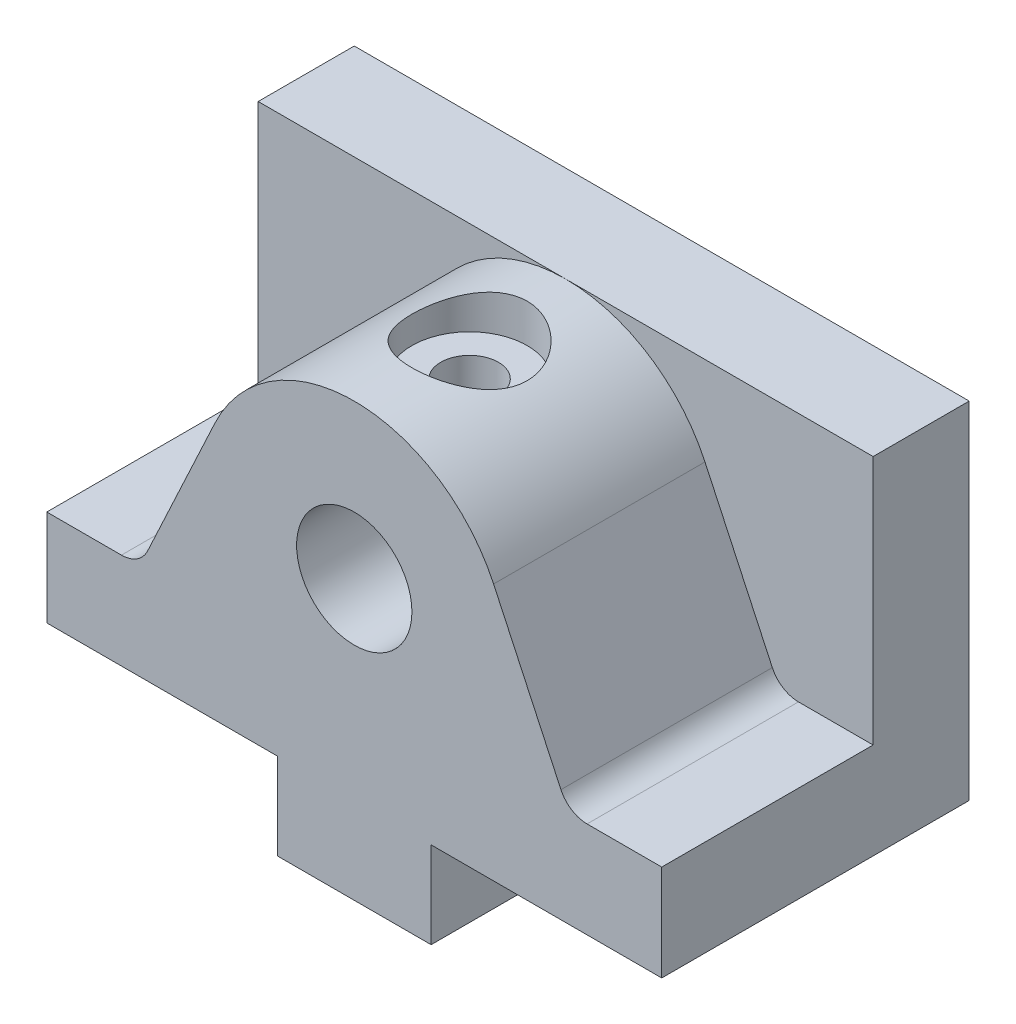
ISO-10303-21;
HEADER;
FILE_DESCRIPTION(('STEP AP214'),'2;1');
FILE_NAME('part.step','',(''),(''),'','','');
FILE_SCHEMA(('AUTOMOTIVE_DESIGN { 1 0 10303 214 1 1 1 1 }'));
ENDSEC;
DATA;
#1=APPLICATION_CONTEXT('core data for automotive mechanical design processes');
#2=APPLICATION_PROTOCOL_DEFINITION('international standard','automotive_design',2000,#1);
#3=PRODUCT_CONTEXT('',#1,'mechanical');
#4=PRODUCT('Part','Part','',(#3));
#5=PRODUCT_RELATED_PRODUCT_CATEGORY('part','',(#4));
#6=PRODUCT_DEFINITION_FORMATION('','',#4);
#7=PRODUCT_DEFINITION_CONTEXT('part definition',#1,'design');
#8=PRODUCT_DEFINITION('design','',#6,#7);
#9=PRODUCT_DEFINITION_SHAPE('','',#8);
#10=(LENGTH_UNIT() NAMED_UNIT(*) SI_UNIT(.MILLI.,.METRE.));
#11=(NAMED_UNIT(*) PLANE_ANGLE_UNIT() SI_UNIT($,.RADIAN.));
#12=(NAMED_UNIT(*) SI_UNIT($,.STERADIAN.) SOLID_ANGLE_UNIT());
#13=UNCERTAINTY_MEASURE_WITH_UNIT(LENGTH_MEASURE(1.E-05),#10,'distance_accuracy_value','');
#14=(GEOMETRIC_REPRESENTATION_CONTEXT(3) GLOBAL_UNCERTAINTY_ASSIGNED_CONTEXT((#13)) GLOBAL_UNIT_ASSIGNED_CONTEXT((#10,
#11,#12)) REPRESENTATION_CONTEXT('',''));
#15=CARTESIAN_POINT('',(0.,0.,0.));
#16=DIRECTION('',(0.,0.,1.));
#17=DIRECTION('',(1.,0.,0.));
#18=AXIS2_PLACEMENT_3D('',#15,#16,#17);
#19=CARTESIAN_POINT('',(-8.,0.,22.));
#20=DIRECTION('',(1.,0.,0.));
#21=DIRECTION('',(0.,1.,0.));
#22=AXIS2_PLACEMENT_3D('',#19,#20,#21);
#23=PLANE('',#22);
#24=DIRECTION('',(0.,0.,-1.));
#25=VECTOR('',#24,1.);
#26=CARTESIAN_POINT('',(-8.,0.,22.));
#27=LINE('',#26,#25);
#28=CARTESIAN_POINT('',(-8.,0.,22.));
#29=VERTEX_POINT('',#28);
#30=CARTESIAN_POINT('',(-8.,0.,-10.));
#31=VERTEX_POINT('',#30);
#32=EDGE_CURVE('E255',#29,#31,#27,.T.);
#33=ORIENTED_EDGE('',*,*,#32,.T.);
#34=DIRECTION('',(0.,1.,0.));
#35=VECTOR('',#34,1.);
#36=CARTESIAN_POINT('',(-8.,0.,-10.));
#37=LINE('',#36,#35);
#38=CARTESIAN_POINT('',(-8.00000000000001,-9.,-10.));
#39=VERTEX_POINT('',#38);
#40=EDGE_CURVE('E205',#39,#31,#37,.T.);
#41=ORIENTED_EDGE('',*,*,#40,.F.);
#42=DIRECTION('',(0.,0.,-1.));
#43=VECTOR('',#42,1.);
#44=CARTESIAN_POINT('',(-8.00000000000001,-9.,22.));
#45=LINE('',#44,#43);
#46=CARTESIAN_POINT('',(-8.00000000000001,-9.,22.));
#47=VERTEX_POINT('',#46);
#48=EDGE_CURVE('E278',#47,#39,#45,.T.);
#49=ORIENTED_EDGE('',*,*,#48,.F.);
#50=DIRECTION('',(0.,-1.,0.));
#51=VECTOR('',#50,1.);
#52=CARTESIAN_POINT('',(-8.,0.,22.));
#53=LINE('',#52,#51);
#54=EDGE_CURVE('E228',#29,#47,#53,.T.);
#55=ORIENTED_EDGE('',*,*,#54,.F.);
#56=EDGE_LOOP('',(#33,#41,#49,#55));
#57=FACE_BOUND('',#56,.T.);
#58=ADVANCED_FACE('F39',(#57),#23,.F.);
#59=CARTESIAN_POINT('',(-8.00000000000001,-9.,22.));
#60=DIRECTION('',(0.,1.,0.));
#61=DIRECTION('',(0.,0.,1.));
#62=AXIS2_PLACEMENT_3D('',#59,#60,#61);
#63=PLANE('',#62);
#64=CARTESIAN_POINT('',(0.,-9.,14.));
#65=DIRECTION('',(0.,-1.,0.));
#66=DIRECTION('',(0.,0.,-1.));
#67=AXIS2_PLACEMENT_3D('',#64,#65,#66);
#68=CIRCLE('',#67,3.);
#69=CARTESIAN_POINT('',(0.,-9.,11.));
#70=VERTEX_POINT('',#69);
#71=EDGE_CURVE('E176',#70,#70,#68,.T.);
#72=ORIENTED_EDGE('',*,*,#71,.F.);
#73=EDGE_LOOP('',(#72));
#74=FACE_BOUND('',#73,.T.);
#75=CARTESIAN_POINT('',(0.,-9.,-2.));
#76=DIRECTION('',(0.,-1.,0.));
#77=DIRECTION('',(0.,0.,-1.));
#78=AXIS2_PLACEMENT_3D('',#75,#76,#77);
#79=CIRCLE('',#78,3.);
#80=CARTESIAN_POINT('',(0.,-9.,-5.));
#81=VERTEX_POINT('',#80);
#82=EDGE_CURVE('E175',#81,#81,#79,.T.);
#83=ORIENTED_EDGE('',*,*,#82,.F.);
#84=EDGE_LOOP('',(#83));
#85=FACE_BOUND('',#84,.T.);
#86=ORIENTED_EDGE('',*,*,#48,.T.);
#87=DIRECTION('',(-1.,0.,0.));
#88=VECTOR('',#87,1.);
#89=CARTESIAN_POINT('',(-8.00000000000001,-9.,-10.));
#90=LINE('',#89,#88);
#91=CARTESIAN_POINT('',(7.99999999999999,-9.,-10.));
#92=VERTEX_POINT('',#91);
#93=EDGE_CURVE('E202',#92,#39,#90,.T.);
#94=ORIENTED_EDGE('',*,*,#93,.F.);
#95=DIRECTION('',(0.,0.,-1.));
#96=VECTOR('',#95,1.);
#97=CARTESIAN_POINT('',(7.99999999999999,-9.,22.));
#98=LINE('',#97,#96);
#99=CARTESIAN_POINT('',(7.99999999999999,-9.,22.));
#100=VERTEX_POINT('',#99);
#101=EDGE_CURVE('E453',#100,#92,#98,.T.);
#102=ORIENTED_EDGE('',*,*,#101,.F.);
#103=DIRECTION('',(1.,0.,0.));
#104=VECTOR('',#103,1.);
#105=CARTESIAN_POINT('',(-8.00000000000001,-9.,22.));
#106=LINE('',#105,#104);
#107=EDGE_CURVE('E231',#47,#100,#106,.T.);
#108=ORIENTED_EDGE('',*,*,#107,.F.);
#109=EDGE_LOOP('',(#86,#94,#102,#108));
#110=FACE_BOUND('',#109,.T.);
#111=ADVANCED_FACE('F313',(#74,#85,#110),#63,.F.);
#112=CARTESIAN_POINT('',(7.99999999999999,-9.,22.));
#113=DIRECTION('',(-1.,0.,0.));
#114=DIRECTION('',(0.,-1.,0.));
#115=AXIS2_PLACEMENT_3D('',#112,#113,#114);
#116=PLANE('',#115);
#117=ORIENTED_EDGE('',*,*,#101,.T.);
#118=DIRECTION('',(0.,-1.,0.));
#119=VECTOR('',#118,1.);
#120=CARTESIAN_POINT('',(7.99999999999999,-9.,-10.));
#121=LINE('',#120,#119);
#122=CARTESIAN_POINT('',(8.,0.,-10.));
#123=VERTEX_POINT('',#122);
#124=EDGE_CURVE('E198',#123,#92,#121,.T.);
#125=ORIENTED_EDGE('',*,*,#124,.F.);
#126=DIRECTION('',(0.,0.,-1.));
#127=VECTOR('',#126,1.);
#128=CARTESIAN_POINT('',(8.,0.,22.));
#129=LINE('',#128,#127);
#130=CARTESIAN_POINT('',(8.,0.,22.));
#131=VERTEX_POINT('',#130);
#132=EDGE_CURVE('E433',#131,#123,#129,.T.);
#133=ORIENTED_EDGE('',*,*,#132,.F.);
#134=DIRECTION('',(0.,1.,0.));
#135=VECTOR('',#134,1.);
#136=CARTESIAN_POINT('',(7.99999999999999,-9.,22.));
#137=LINE('',#136,#135);
#138=EDGE_CURVE('E234',#100,#131,#137,.T.);
#139=ORIENTED_EDGE('',*,*,#138,.F.);
#140=EDGE_LOOP('',(#117,#125,#133,#139));
#141=FACE_BOUND('',#140,.T.);
#142=ADVANCED_FACE('F319',(#141),#116,.F.);
#143=CARTESIAN_POINT('',(8.,0.,22.));
#144=DIRECTION('',(0.,1.,0.));
#145=DIRECTION('',(0.,0.,1.));
#146=AXIS2_PLACEMENT_3D('',#143,#144,#145);
#147=PLANE('',#146);
#148=ORIENTED_EDGE('',*,*,#132,.T.);
#149=DIRECTION('',(-1.,0.,0.));
#150=VECTOR('',#149,1.);
#151=CARTESIAN_POINT('',(8.,0.,-10.));
#152=LINE('',#151,#150);
#153=CARTESIAN_POINT('',(32.,0.,-10.));
#154=VERTEX_POINT('',#153);
#155=EDGE_CURVE('E195',#154,#123,#152,.T.);
#156=ORIENTED_EDGE('',*,*,#155,.F.);
#157=DIRECTION('',(0.,0.,-1.));
#158=VECTOR('',#157,1.);
#159=CARTESIAN_POINT('',(32.,0.,22.));
#160=LINE('',#159,#158);
#161=CARTESIAN_POINT('',(32.,0.,22.));
#162=VERTEX_POINT('',#161);
#163=EDGE_CURVE('E431',#162,#154,#160,.T.);
#164=ORIENTED_EDGE('',*,*,#163,.F.);
#165=DIRECTION('',(1.,0.,0.));
#166=VECTOR('',#165,1.);
#167=CARTESIAN_POINT('',(8.,0.,22.));
#168=LINE('',#167,#166);
#169=EDGE_CURVE('E236',#131,#162,#168,.T.);
#170=ORIENTED_EDGE('',*,*,#169,.F.);
#171=EDGE_LOOP('',(#148,#156,#164,#170));
#172=FACE_BOUND('',#171,.T.);
#173=ADVANCED_FACE('F325',(#172),#147,.F.);
#174=CARTESIAN_POINT('',(32.,0.,22.));
#175=DIRECTION('',(-1.,0.,0.));
#176=DIRECTION('',(0.,0.,1.));
#177=AXIS2_PLACEMENT_3D('',#174,#175,#176);
#178=PLANE('',#177);
#179=ORIENTED_EDGE('',*,*,#163,.T.);
#180=DIRECTION('',(0.,-1.,0.));
#181=VECTOR('',#180,1.);
#182=CARTESIAN_POINT('',(32.,36.,-10.));
#183=LINE('',#182,#181);
#184=CARTESIAN_POINT('',(32.,36.,-10.));
#185=VERTEX_POINT('',#184);
#186=EDGE_CURVE('E215',#185,#154,#183,.T.);
#187=ORIENTED_EDGE('',*,*,#186,.F.);
#188=DIRECTION('',(0.,0.,1.));
#189=VECTOR('',#188,1.);
#190=CARTESIAN_POINT('',(32.,36.,-10.));
#191=LINE('',#190,#189);
#192=CARTESIAN_POINT('',(32.,36.,0.));
#193=VERTEX_POINT('',#192);
#194=EDGE_CURVE('E218',#185,#193,#191,.T.);
#195=ORIENTED_EDGE('',*,*,#194,.T.);
#196=DIRECTION('',(0.,-1.,0.));
#197=VECTOR('',#196,1.);
#198=CARTESIAN_POINT('',(32.,0.,0.));
#199=LINE('',#198,#197);
#200=CARTESIAN_POINT('',(32.,10.,0.));
#201=VERTEX_POINT('',#200);
#202=EDGE_CURVE('E199',#193,#201,#199,.T.);
#203=ORIENTED_EDGE('',*,*,#202,.T.);
#204=DIRECTION('',(0.,0.,-1.));
#205=VECTOR('',#204,1.);
#206=CARTESIAN_POINT('',(32.,10.,22.));
#207=LINE('',#206,#205);
#208=CARTESIAN_POINT('',(32.,10.,22.));
#209=VERTEX_POINT('',#208);
#210=EDGE_CURVE('E429',#209,#201,#207,.T.);
#211=ORIENTED_EDGE('',*,*,#210,.F.);
#212=DIRECTION('',(0.,1.,0.));
#213=VECTOR('',#212,1.);
#214=CARTESIAN_POINT('',(32.,0.,22.));
#215=LINE('',#214,#213);
#216=EDGE_CURVE('E238',#162,#209,#215,.T.);
#217=ORIENTED_EDGE('',*,*,#216,.F.);
#218=EDGE_LOOP('',(#179,#187,#195,#203,#211,#217));
#219=FACE_BOUND('',#218,.T.);
#220=ADVANCED_FACE('F329',(#219),#178,.F.);
#221=CARTESIAN_POINT('',(32.,10.,22.));
#222=DIRECTION('',(0.,-1.,0.));
#223=DIRECTION('',(1.,0.,0.));
#224=AXIS2_PLACEMENT_3D('',#221,#222,#223);
#225=PLANE('',#224);
#226=DIRECTION('',(-1.,0.,0.));
#227=VECTOR('',#226,1.);
#228=CARTESIAN_POINT('',(32.,10.,0.));
#229=LINE('',#228,#227);
#230=CARTESIAN_POINT('',(24.2283340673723,9.99999999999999,0.));
#231=VERTEX_POINT('',#230);
#232=EDGE_CURVE('E259',#201,#231,#229,.T.);
#233=ORIENTED_EDGE('',*,*,#232,.T.);
#234=DIRECTION('',(0.,0.,-1.));
#235=VECTOR('',#234,1.);
#236=CARTESIAN_POINT('',(24.2283340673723,9.99999999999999,22.));
#237=LINE('',#236,#235);
#238=CARTESIAN_POINT('',(24.2283340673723,9.99999999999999,22.));
#239=VERTEX_POINT('',#238);
#240=EDGE_CURVE('E59',#231,#239,#237,.F.);
#241=ORIENTED_EDGE('',*,*,#240,.T.);
#242=DIRECTION('',(-1.,0.,0.));
#243=VECTOR('',#242,1.);
#244=CARTESIAN_POINT('',(32.,10.,22.));
#245=LINE('',#244,#243);
#246=EDGE_CURVE('E240',#209,#239,#245,.T.);
#247=ORIENTED_EDGE('',*,*,#246,.F.);
#248=ORIENTED_EDGE('',*,*,#210,.T.);
#249=EDGE_LOOP('',(#233,#241,#247,#248));
#250=FACE_BOUND('',#249,.T.);
#251=ADVANCED_FACE('F333',(#250),#225,.F.);
#252=CARTESIAN_POINT('',(22.3171232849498,9.99999999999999,22.));
#253=DIRECTION('',(-0.906307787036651,-0.422618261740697,0.));
#254=DIRECTION('',(0.422618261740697,-0.906307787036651,0.));
#255=AXIS2_PLACEMENT_3D('',#252,#253,#254);
#256=PLANE('',#255);
#257=DIRECTION('',(-0.422618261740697,0.906307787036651,0.));
#258=VECTOR('',#257,1.);
#259=CARTESIAN_POINT('',(22.3171232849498,9.99999999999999,22.));
#260=LINE('',#259,#258);
#261=CARTESIAN_POINT('',(21.5094107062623,11.7321452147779,22.));
#262=VERTEX_POINT('',#261);
#263=CARTESIAN_POINT('',(14.5009245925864,26.7618921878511,22.));
#264=VERTEX_POINT('',#263);
#265=EDGE_CURVE('E242',#262,#264,#260,.T.);
#266=ORIENTED_EDGE('',*,*,#265,.F.);
#267=DIRECTION('',(0.,0.,-1.));
#268=VECTOR('',#267,1.);
#269=CARTESIAN_POINT('',(21.5094107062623,11.7321452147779,0.));
#270=LINE('',#269,#268);
#271=CARTESIAN_POINT('',(21.5094107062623,11.7321452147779,0.));
#272=VERTEX_POINT('',#271);
#273=EDGE_CURVE('E282',#262,#272,#270,.T.);
#274=ORIENTED_EDGE('',*,*,#273,.T.);
#275=DIRECTION('',(-0.422618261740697,0.906307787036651,0.));
#276=VECTOR('',#275,1.);
#277=CARTESIAN_POINT('',(22.3171232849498,9.99999999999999,0.));
#278=LINE('',#277,#276);
#279=CARTESIAN_POINT('',(14.5009245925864,26.7618921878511,0.));
#280=VERTEX_POINT('',#279);
#281=EDGE_CURVE('E256',#272,#280,#278,.T.);
#282=ORIENTED_EDGE('',*,*,#281,.T.);
#283=DIRECTION('',(0.,0.,-1.));
#284=VECTOR('',#283,1.);
#285=CARTESIAN_POINT('',(14.5009245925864,26.7618921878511,22.));
#286=LINE('',#285,#284);
#287=EDGE_CURVE('E298',#264,#280,#286,.T.);
#288=ORIENTED_EDGE('',*,*,#287,.F.);
#289=EDGE_LOOP('',(#266,#274,#282,#288));
#290=FACE_BOUND('',#289,.T.);
#291=ADVANCED_FACE('F296',(#290),#256,.F.);
#292=CARTESIAN_POINT('',(0.,20.,22.));
#293=DIRECTION('',(0.,0.,-1.));
#294=DIRECTION('',(-1.,0.,0.));
#295=AXIS2_PLACEMENT_3D('',#292,#293,#294);
#296=CYLINDRICAL_SURFACE('',#295,16.);
#297=CARTESIAN_POINT('',(0.,36.,16.));
#298=CARTESIAN_POINT('',(-0.162427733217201,36.0000005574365,16.0000007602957));
#299=CARTESIAN_POINT('',(-0.324844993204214,35.997521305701,15.9933993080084));
#300=CARTESIAN_POINT('',(-0.648520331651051,35.9876715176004,15.9670588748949));
#301=CARTESIAN_POINT('',(-0.809777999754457,35.9802993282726,15.9473154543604));
#302=CARTESIAN_POINT('',(-1.12979634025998,35.9608661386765,15.8948993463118));
#303=CARTESIAN_POINT('',(-1.28855831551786,35.9488076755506,15.862233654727));
#304=CARTESIAN_POINT('',(-1.60261141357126,35.920317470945,15.7842738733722));
#305=CARTESIAN_POINT('',(-1.75790116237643,35.9038840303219,15.7389748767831));
#306=CARTESIAN_POINT('',(-2.06353693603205,35.8671186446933,15.6362882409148));
#307=CARTESIAN_POINT('',(-2.2138937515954,35.8467959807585,15.5789293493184));
#308=CARTESIAN_POINT('',(-2.50915130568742,35.8027355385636,15.4525186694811));
#309=CARTESIAN_POINT('',(-2.6540499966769,35.7789964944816,15.3834625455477));
#310=CARTESIAN_POINT('',(-2.93745114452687,35.7287028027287,15.2342168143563));
#311=CARTESIAN_POINT('',(-3.07595454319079,35.7021485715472,15.1540288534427));
#312=CARTESIAN_POINT('',(-3.3458591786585,35.6468595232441,14.9830470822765));
#313=CARTESIAN_POINT('',(-3.47725782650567,35.618123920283,14.8922494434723));
#314=CARTESIAN_POINT('',(-3.73705610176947,35.5580480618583,14.6970003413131));
#315=CARTESIAN_POINT('',(-3.86515055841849,35.5266502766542,14.5921603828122));
#316=CARTESIAN_POINT('',(-4.11214204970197,35.4630706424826,14.372369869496));
#317=CARTESIAN_POINT('',(-4.23103881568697,35.4308887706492,14.2574190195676));
#318=CARTESIAN_POINT('',(-4.45900396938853,35.3665649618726,14.0180360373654));
#319=CARTESIAN_POINT('',(-4.56806779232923,35.334423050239,13.8935995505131));
#320=CARTESIAN_POINT('',(-4.7756151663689,35.2710599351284,13.6360477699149));
#321=CARTESIAN_POINT('',(-4.87410227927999,35.2398384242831,13.5029354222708));
#322=CARTESIAN_POINT('',(-5.06349317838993,35.1779887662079,13.2234482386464));
#323=CARTESIAN_POINT('',(-5.15395768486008,35.1474300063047,13.0767598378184));
#324=CARTESIAN_POINT('',(-5.32210766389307,35.0891712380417,12.7757656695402));
#325=CARTESIAN_POINT('',(-5.39979826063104,35.0614700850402,12.6214629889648));
#326=CARTESIAN_POINT('',(-5.54178841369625,35.0098065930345,12.3061815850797));
#327=CARTESIAN_POINT('',(-5.60608640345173,34.9858446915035,12.1452020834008));
#328=CARTESIAN_POINT('',(-5.72063465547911,34.9424928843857,11.81780057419));
#329=CARTESIAN_POINT('',(-5.77089169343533,34.9231007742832,11.6513812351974));
#330=CARTESIAN_POINT('',(-5.85511762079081,34.8902504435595,11.3211525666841));
#331=CARTESIAN_POINT('',(-5.88966490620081,34.8765832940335,11.1575115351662));
#332=CARTESIAN_POINT('',(-5.94499608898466,34.8545586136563,10.8276330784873));
#333=CARTESIAN_POINT('',(-5.96578600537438,34.8461987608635,10.6613968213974));
#334=CARTESIAN_POINT('',(-5.99338932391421,34.8350769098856,10.3276054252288));
#335=CARTESIAN_POINT('',(-6.00020481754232,34.8323140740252,10.1600504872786));
#336=CARTESIAN_POINT('',(-5.99978582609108,34.8324836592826,9.82496442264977));
#337=CARTESIAN_POINT('',(-5.99255188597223,34.8354158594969,9.65743329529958));
#338=CARTESIAN_POINT('',(-5.9649764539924,34.8465233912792,9.33379681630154));
#339=CARTESIAN_POINT('',(-5.94544909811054,34.8543729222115,9.17761005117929));
#340=CARTESIAN_POINT('',(-5.89424692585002,34.8747642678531,8.86749914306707));
#341=CARTESIAN_POINT('',(-5.86256807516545,34.887307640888,8.713575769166));
#342=CARTESIAN_POINT('',(-5.78737202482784,34.9167004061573,8.40911721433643));
#343=CARTESIAN_POINT('',(-5.74385788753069,34.9335486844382,8.25858116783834));
#344=CARTESIAN_POINT('',(-5.64535023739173,34.9710653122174,7.96174446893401));
#345=CARTESIAN_POINT('',(-5.59035233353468,34.9917351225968,7.8154454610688));
#346=CARTESIAN_POINT('',(-5.46820476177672,35.0367233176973,7.52533536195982));
#347=CARTESIAN_POINT('',(-5.40084887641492,35.0611021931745,7.3816205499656));
#348=CARTESIAN_POINT('',(-5.25517504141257,35.112547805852,7.10030421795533));
#349=CARTESIAN_POINT('',(-5.17685336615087,35.1396154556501,6.96270479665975));
#350=CARTESIAN_POINT('',(-5.00978390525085,35.1957174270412,6.69439199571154));
#351=CARTESIAN_POINT('',(-4.92103495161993,35.2247519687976,6.56367938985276));
#352=CARTESIAN_POINT('',(-4.73365945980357,35.2840480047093,6.30982948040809));
#353=CARTESIAN_POINT('',(-4.63503247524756,35.3143095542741,6.18669251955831));
#354=CARTESIAN_POINT('',(-4.42148606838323,35.3773753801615,5.94059609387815));
#355=CARTESIAN_POINT('',(-4.30591643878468,35.4102134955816,5.81820873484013));
#356=CARTESIAN_POINT('',(-4.06489568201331,35.4755357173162,5.58356444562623));
#357=CARTESIAN_POINT('',(-3.93944756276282,35.5080199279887,5.47130445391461));
#358=CARTESIAN_POINT('',(-3.67930542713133,35.5717902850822,5.25752502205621));
#359=CARTESIAN_POINT('',(-3.54460652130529,35.6030757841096,5.15601133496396));
#360=CARTESIAN_POINT('',(-3.26687700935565,35.6635788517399,4.96453057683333));
#361=CARTESIAN_POINT('',(-3.1238497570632,35.6927972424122,4.87455890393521));
#362=CARTESIAN_POINT('',(-2.8279450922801,35.7488334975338,4.7054533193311));
#363=CARTESIAN_POINT('',(-2.67494692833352,35.7756056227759,4.62651523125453));
#364=CARTESIAN_POINT('',(-2.3622882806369,35.8254428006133,4.48191640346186));
#365=CARTESIAN_POINT('',(-2.20263047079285,35.8485093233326,4.4162503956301));
#366=CARTESIAN_POINT('',(-1.87775996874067,35.8902747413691,4.29878554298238));
#367=CARTESIAN_POINT('',(-1.71254812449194,35.9089742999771,4.24698459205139));
#368=CARTESIAN_POINT('',(-1.37781252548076,35.941452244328,4.15777194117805));
#369=CARTESIAN_POINT('',(-1.20828902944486,35.9552309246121,4.12035938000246));
#370=CARTESIAN_POINT('',(-0.875397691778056,35.9768584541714,4.06192787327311));
#371=CARTESIAN_POINT('',(-0.71218192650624,35.9849836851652,4.04014291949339));
#372=CARTESIAN_POINT('',(-0.384342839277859,35.9962238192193,4.01006070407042));
#373=CARTESIAN_POINT('',(-0.219719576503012,35.9993389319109,4.00176287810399));
#374=CARTESIAN_POINT('',(0.10963649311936,36.0004717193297,3.99874206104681));
#375=CARTESIAN_POINT('',(0.274369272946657,35.9984903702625,4.0040164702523));
#376=CARTESIAN_POINT('',(0.602703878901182,35.9894877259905,4.02807883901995));
#377=CARTESIAN_POINT('',(0.766305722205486,35.9824665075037,4.04686659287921));
#378=CARTESIAN_POINT('',(1.08484961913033,35.9639458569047,4.09677376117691));
#379=CARTESIAN_POINT('',(1.23988188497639,35.9526301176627,4.1273881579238));
#380=CARTESIAN_POINT('',(1.54675761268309,35.9258052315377,4.20065226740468));
#381=CARTESIAN_POINT('',(1.69860000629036,35.9102947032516,4.24330594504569));
#382=CARTESIAN_POINT('',(1.99802063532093,35.8754724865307,4.3402587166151));
#383=CARTESIAN_POINT('',(2.14560001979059,35.85616183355,4.39455463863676));
#384=CARTESIAN_POINT('',(2.43569439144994,35.8141987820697,4.51437951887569));
#385=CARTESIAN_POINT('',(2.5782074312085,35.791545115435,4.57991274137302));
#386=CARTESIAN_POINT('',(2.8613459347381,35.7427421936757,4.72376640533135));
#387=CARTESIAN_POINT('',(3.00179672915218,35.7165106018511,4.80240263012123));
#388=CARTESIAN_POINT('',(3.27565209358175,35.6617244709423,4.97049434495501));
#389=CARTESIAN_POINT('',(3.40905422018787,35.6331691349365,5.05995355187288));
#390=CARTESIAN_POINT('',(3.66805220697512,35.574435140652,5.24909372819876));
#391=CARTESIAN_POINT('',(3.79364691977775,35.5442562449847,5.34877619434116));
#392=CARTESIAN_POINT('',(4.03634135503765,35.4830105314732,5.55774902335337));
#393=CARTESIAN_POINT('',(4.1534407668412,35.4519436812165,5.66703973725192));
#394=CARTESIAN_POINT('',(4.3850769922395,35.3878643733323,5.9012462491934));
#395=CARTESIAN_POINT('',(4.49906697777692,35.3548440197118,6.02670141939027));
#396=CARTESIAN_POINT('',(4.71608180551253,35.2895850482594,6.28687984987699));
#397=CARTESIAN_POINT('',(4.81911014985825,35.2573461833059,6.42160012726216));
#398=CARTESIAN_POINT('',(5.01360921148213,35.194544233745,6.69961873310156));
#399=CARTESIAN_POINT('',(5.10507411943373,35.163981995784,6.84292132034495));
#400=CARTESIAN_POINT('',(5.27567954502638,35.1054737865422,7.13711577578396));
#401=CARTESIAN_POINT('',(5.35482524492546,35.0775267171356,7.2880044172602));
#402=CARTESIAN_POINT('',(5.50053123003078,35.0249854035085,7.59718997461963));
#403=CARTESIAN_POINT('',(5.5670312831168,35.0004073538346,7.75551807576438));
#404=CARTESIAN_POINT('',(5.68634828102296,34.9555845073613,8.07777478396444));
#405=CARTESIAN_POINT('',(5.73917096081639,34.9353378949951,8.241701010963));
#406=CARTESIAN_POINT('',(5.8306145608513,34.89987725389,8.57395243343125));
#407=CARTESIAN_POINT('',(5.86923979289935,34.884661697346,8.74227627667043));
#408=CARTESIAN_POINT('',(5.93187603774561,34.8598111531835,9.08202494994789));
#409=CARTESIAN_POINT('',(5.95588806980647,34.8501757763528,9.25344956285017));
#410=CARTESIAN_POINT('',(5.98795090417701,34.8372746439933,9.58688079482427));
#411=CARTESIAN_POINT('',(5.99692832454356,34.8336393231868,9.74878464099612));
#412=CARTESIAN_POINT('',(6.00174553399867,34.8316910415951,10.0728179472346));
#413=CARTESIAN_POINT('',(5.99758576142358,34.8333779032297,10.2349473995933));
#414=CARTESIAN_POINT('',(5.97617513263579,34.8420167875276,10.5581793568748));
#415=CARTESIAN_POINT('',(5.9589255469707,34.8489682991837,10.7192819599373));
#416=CARTESIAN_POINT('',(5.91152013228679,34.8679043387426,11.0392740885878));
#417=CARTESIAN_POINT('',(5.88136431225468,34.8798888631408,11.1981636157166));
#418=CARTESIAN_POINT('',(5.80957518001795,34.9080606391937,11.5077481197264));
#419=CARTESIAN_POINT('',(5.76832374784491,34.9241071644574,11.65854478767));
#420=CARTESIAN_POINT('',(5.67433519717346,34.9600952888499,11.9560860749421));
#421=CARTESIAN_POINT('',(5.62159429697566,34.9800381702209,12.1028293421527));
#422=CARTESIAN_POINT('',(5.50506367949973,35.0232530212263,12.3913315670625));
#423=CARTESIAN_POINT('',(5.44127561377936,35.0465244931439,12.5330912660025));
#424=CARTESIAN_POINT('',(5.30311395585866,35.0957729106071,12.8108859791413));
#425=CARTESIAN_POINT('',(5.22873653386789,35.1217508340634,12.9469188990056));
#426=CARTESIAN_POINT('',(4.98217098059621,35.2055628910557,13.359141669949));
#427=CARTESIAN_POINT('',(4.79257489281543,35.2669336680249,13.6244522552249));
#428=CARTESIAN_POINT('',(4.37331782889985,35.3922641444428,14.1206371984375));
#429=CARTESIAN_POINT('',(4.14364411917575,35.4562246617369,14.3515005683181));
#430=CARTESIAN_POINT('',(3.76647526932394,35.5509413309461,14.6736561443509));
#431=CARTESIAN_POINT('',(3.63140882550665,35.5831105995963,14.7793645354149));
#432=CARTESIAN_POINT('',(3.35244180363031,35.6454953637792,14.979007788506));
#433=CARTESIAN_POINT('',(3.2085445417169,35.6757115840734,15.0729470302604));
#434=CARTESIAN_POINT('',(2.9127270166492,35.7333640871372,15.2483917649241));
#435=CARTESIAN_POINT('',(2.76080251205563,35.7607988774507,15.3298905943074));
#436=CARTESIAN_POINT('',(2.45006904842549,35.8120821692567,15.4796800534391));
#437=CARTESIAN_POINT('',(2.29126304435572,35.8359321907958,15.5479762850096));
#438=CARTESIAN_POINT('',(1.96075860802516,35.8803154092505,15.6734482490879));
#439=CARTESIAN_POINT('',(1.78880001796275,35.9006582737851,15.7300080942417));
#440=CARTESIAN_POINT('',(1.43995213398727,35.9360368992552,15.8274639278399));
#441=CARTESIAN_POINT('',(1.26306259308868,35.9510723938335,15.8683591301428));
#442=CARTESIAN_POINT('',(0.905989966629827,35.9753306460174,15.9339800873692));
#443=CARTESIAN_POINT('',(0.725808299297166,35.9845558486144,15.9587126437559));
#444=CARTESIAN_POINT('',(0.363746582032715,35.9968898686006,15.9917212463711));
#445=CARTESIAN_POINT('',(0.181866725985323,35.9999993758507,15.9999991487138));
#446=CARTESIAN_POINT('',(0.,36.,16.));
#447=B_SPLINE_CURVE_WITH_KNOTS('',3,(#297,#298,#299,#300,#301,#302,#303,#304,#305,#306,#307,
#308,#309,#310,#311,#312,#313,#314,#315,#316,#317,#318,#319,#320,#321,#322,#323,#324,#325,#326,
#327,#328,#329,#330,#331,#332,#333,#334,#335,#336,#337,#338,#339,#340,#341,#342,#343,#344,#345,
#346,#347,#348,#349,#350,#351,#352,#353,#354,#355,#356,#357,#358,#359,#360,#361,#362,#363,#364,
#365,#366,#367,#368,#369,#370,#371,#372,#373,#374,#375,#376,#377,#378,#379,#380,#381,#382,#383,
#384,#385,#386,#387,#388,#389,#390,#391,#392,#393,#394,#395,#396,#397,#398,#399,#400,#401,#402,
#403,#404,#405,#406,#407,#408,#409,#410,#411,#412,#413,#414,#415,#416,#417,#418,#419,#420,#421,
#422,#423,#424,#425,#426,#427,#428,#429,#430,#431,#432,#433,#434,#435,#436,#437,#438,#439,#440,
#441,#442,#443,#444,#445,#446),.UNSPECIFIED.,.T.,.F.,(4,2,2,2,2,2,2,2,2,2,2,2,2,2,2,2,2,2,2,2,2,
2,2,2,2,2,2,2,2,2,2,2,2,2,2,2,2,2,2,2,2,2,2,2,2,2,2,2,2,2,2,2,2,2,2,2,2,2,2,2,2,2,2,2,2,2,2,2,2,
2,2,2,2,2,4),(0.,0.48711292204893,0.974390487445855,1.46140460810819,1.94860815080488,
2.43466323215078,2.92089887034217,3.40706267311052,3.89340245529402,4.39827808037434,
4.90316844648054,5.40829200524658,5.91324492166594,6.43768308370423,6.96191035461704,
7.48619891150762,8.01023402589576,8.51299593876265,9.01553774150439,9.51800432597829,
10.0204514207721,10.4926927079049,10.9650909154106,11.4373670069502,11.9098240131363,
12.3910323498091,12.8724045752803,13.3538307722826,13.8352787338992,14.349198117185,
14.8629616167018,15.3769987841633,15.8908303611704,16.4128602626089,16.9346825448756,
17.4564255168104,17.9781372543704,18.4721042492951,18.9660505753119,19.4599022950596,
19.9537464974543,20.4284916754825,20.9033933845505,21.3781658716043,21.8531189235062,
22.3418491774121,22.830747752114,23.3197180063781,23.8087061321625,24.3261847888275,
24.8434976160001,25.3610693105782,25.8784226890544,26.3981817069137,26.9177224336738,
27.4371052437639,27.9564518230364,28.4424210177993,28.9283739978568,29.4142798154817,
29.9001852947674,30.3711334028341,30.8422367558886,31.3132697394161,31.7844735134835,
32.7753369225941,33.7665157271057,34.2894950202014,34.8122791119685,35.3353422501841,
35.8581829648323,36.4038564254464,36.9495572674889,37.4950283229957,38.0404378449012),.UNSPECIFIED.);
#448=CARTESIAN_POINT('',(0.,36.,16.));
#449=VERTEX_POINT('',#448);
#450=EDGE_CURVE('E11',#449,#449,#447,.T.);
#451=ORIENTED_EDGE('',*,*,#450,.T.);
#452=EDGE_LOOP('',(#451));
#453=FACE_BOUND('',#452,.T.);
#454=CARTESIAN_POINT('',(0.,20.,0.));
#455=DIRECTION('',(0.,0.,1.));
#456=DIRECTION('',(1.,0.,0.));
#457=AXIS2_PLACEMENT_3D('',#454,#455,#456);
#458=CIRCLE('',#457,16.);
#459=CARTESIAN_POINT('',(0.,36.,0.));
#460=VERTEX_POINT('',#459);
#461=EDGE_CURVE('E260',#280,#460,#458,.T.);
#462=ORIENTED_EDGE('',*,*,#461,.T.);
#463=CARTESIAN_POINT('',(-14.5009245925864,26.7618921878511,0.));
#464=VERTEX_POINT('',#463);
#465=EDGE_CURVE('E258',#460,#464,#458,.T.);
#466=ORIENTED_EDGE('',*,*,#465,.T.);
#467=DIRECTION('',(0.,0.,-1.));
#468=VECTOR('',#467,1.);
#469=CARTESIAN_POINT('',(-14.5009245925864,26.7618921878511,22.));
#470=LINE('',#469,#468);
#471=CARTESIAN_POINT('',(-14.5009245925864,26.7618921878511,22.));
#472=VERTEX_POINT('',#471);
#473=EDGE_CURVE('E435',#472,#464,#470,.T.);
#474=ORIENTED_EDGE('',*,*,#473,.F.);
#475=CARTESIAN_POINT('',(0.,20.,22.));
#476=DIRECTION('',(0.,0.,1.));
#477=DIRECTION('',(1.,0.,0.));
#478=AXIS2_PLACEMENT_3D('',#475,#476,#477);
#479=CIRCLE('',#478,16.);
#480=EDGE_CURVE('E244',#264,#472,#479,.T.);
#481=ORIENTED_EDGE('',*,*,#480,.F.);
#482=ORIENTED_EDGE('',*,*,#287,.T.);
#483=EDGE_LOOP('',(#462,#466,#474,#481,#482));
#484=FACE_BOUND('',#483,.T.);
#485=ADVANCED_FACE('F338',(#453,#484),#296,.T.);
#486=CARTESIAN_POINT('',(-14.5009245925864,26.7618921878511,22.));
#487=DIRECTION('',(0.906307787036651,-0.422618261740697,0.));
#488=DIRECTION('',(0.422618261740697,0.906307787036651,0.));
#489=AXIS2_PLACEMENT_3D('',#486,#487,#488);
#490=PLANE('',#489);
#491=DIRECTION('',(-0.422618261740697,-0.906307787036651,0.));
#492=VECTOR('',#491,1.);
#493=CARTESIAN_POINT('',(-14.5009245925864,26.7618921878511,0.));
#494=LINE('',#493,#492);
#495=CARTESIAN_POINT('',(-21.5094107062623,11.7321452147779,0.));
#496=VERTEX_POINT('',#495);
#497=EDGE_CURVE('E263',#464,#496,#494,.T.);
#498=ORIENTED_EDGE('',*,*,#497,.T.);
#499=DIRECTION('',(0.,0.,-1.));
#500=VECTOR('',#499,1.);
#501=CARTESIAN_POINT('',(-21.5094107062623,11.7321452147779,22.));
#502=LINE('',#501,#500);
#503=CARTESIAN_POINT('',(-21.5094107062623,11.7321452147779,22.));
#504=VERTEX_POINT('',#503);
#505=EDGE_CURVE('E280',#496,#504,#502,.F.);
#506=ORIENTED_EDGE('',*,*,#505,.T.);
#507=DIRECTION('',(-0.422618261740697,-0.906307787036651,0.));
#508=VECTOR('',#507,1.);
#509=CARTESIAN_POINT('',(-14.5009245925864,26.7618921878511,22.));
#510=LINE('',#509,#508);
#511=EDGE_CURVE('E246',#472,#504,#510,.T.);
#512=ORIENTED_EDGE('',*,*,#511,.F.);
#513=ORIENTED_EDGE('',*,*,#473,.T.);
#514=EDGE_LOOP('',(#498,#506,#512,#513));
#515=FACE_BOUND('',#514,.T.);
#516=ADVANCED_FACE('F342',(#515),#490,.F.);
#517=CARTESIAN_POINT('',(-22.3171232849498,9.99999999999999,22.));
#518=DIRECTION('',(0.,-1.,0.));
#519=DIRECTION('',(1.,0.,0.));
#520=AXIS2_PLACEMENT_3D('',#517,#518,#519);
#521=PLANE('',#520);
#522=DIRECTION('',(-1.,0.,0.));
#523=VECTOR('',#522,1.);
#524=CARTESIAN_POINT('',(-22.3171232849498,9.99999999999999,22.));
#525=LINE('',#524,#523);
#526=CARTESIAN_POINT('',(-24.2283340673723,9.99999999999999,22.));
#527=VERTEX_POINT('',#526);
#528=CARTESIAN_POINT('',(-32.,10.,22.));
#529=VERTEX_POINT('',#528);
#530=EDGE_CURVE('E249',#527,#529,#525,.T.);
#531=ORIENTED_EDGE('',*,*,#530,.F.);
#532=DIRECTION('',(0.,0.,-1.));
#533=VECTOR('',#532,1.);
#534=CARTESIAN_POINT('',(-24.2283340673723,9.99999999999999,0.));
#535=LINE('',#534,#533);
#536=CARTESIAN_POINT('',(-24.2283340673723,9.99999999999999,0.));
#537=VERTEX_POINT('',#536);
#538=EDGE_CURVE('E274',#527,#537,#535,.T.);
#539=ORIENTED_EDGE('',*,*,#538,.T.);
#540=DIRECTION('',(-1.,0.,0.));
#541=VECTOR('',#540,1.);
#542=CARTESIAN_POINT('',(-22.3171232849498,9.99999999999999,0.));
#543=LINE('',#542,#541);
#544=CARTESIAN_POINT('',(-32.,10.,0.));
#545=VERTEX_POINT('',#544);
#546=EDGE_CURVE('E232',#537,#545,#543,.T.);
#547=ORIENTED_EDGE('',*,*,#546,.T.);
#548=DIRECTION('',(0.,0.,-1.));
#549=VECTOR('',#548,1.);
#550=CARTESIAN_POINT('',(-32.,10.,22.));
#551=LINE('',#550,#549);
#552=EDGE_CURVE('E442',#529,#545,#551,.T.);
#553=ORIENTED_EDGE('',*,*,#552,.F.);
#554=EDGE_LOOP('',(#531,#539,#547,#553));
#555=FACE_BOUND('',#554,.T.);
#556=ADVANCED_FACE('F346',(#555),#521,.F.);
#557=CARTESIAN_POINT('',(-32.,10.,22.));
#558=DIRECTION('',(1.,0.,0.));
#559=DIRECTION('',(0.,0.,-1.));
#560=AXIS2_PLACEMENT_3D('',#557,#558,#559);
#561=PLANE('',#560);
#562=ORIENTED_EDGE('',*,*,#552,.T.);
#563=DIRECTION('',(0.,1.,0.));
#564=VECTOR('',#563,1.);
#565=CARTESIAN_POINT('',(-32.,36.,0.));
#566=LINE('',#565,#564);
#567=CARTESIAN_POINT('',(-32.,36.,0.));
#568=VERTEX_POINT('',#567);
#569=EDGE_CURVE('E192',#545,#568,#566,.T.);
#570=ORIENTED_EDGE('',*,*,#569,.T.);
#571=DIRECTION('',(0.,0.,1.));
#572=VECTOR('',#571,1.);
#573=CARTESIAN_POINT('',(-32.,36.,-10.));
#574=LINE('',#573,#572);
#575=CARTESIAN_POINT('',(-32.,36.,-10.));
#576=VERTEX_POINT('',#575);
#577=EDGE_CURVE('E424',#576,#568,#574,.T.);
#578=ORIENTED_EDGE('',*,*,#577,.F.);
#579=DIRECTION('',(0.,1.,0.));
#580=VECTOR('',#579,1.);
#581=CARTESIAN_POINT('',(-32.,10.,-10.));
#582=LINE('',#581,#580);
#583=CARTESIAN_POINT('',(-32.,0.,-10.));
#584=VERTEX_POINT('',#583);
#585=EDGE_CURVE('E211',#584,#576,#582,.T.);
#586=ORIENTED_EDGE('',*,*,#585,.F.);
#587=DIRECTION('',(0.,0.,-1.));
#588=VECTOR('',#587,1.);
#589=CARTESIAN_POINT('',(-32.,0.,22.));
#590=LINE('',#589,#588);
#591=CARTESIAN_POINT('',(-32.,0.,22.));
#592=VERTEX_POINT('',#591);
#593=EDGE_CURVE('E444',#592,#584,#590,.T.);
#594=ORIENTED_EDGE('',*,*,#593,.F.);
#595=DIRECTION('',(0.,-1.,0.));
#596=VECTOR('',#595,1.);
#597=CARTESIAN_POINT('',(-32.,10.,22.));
#598=LINE('',#597,#596);
#599=EDGE_CURVE('E251',#529,#592,#598,.T.);
#600=ORIENTED_EDGE('',*,*,#599,.F.);
#601=EDGE_LOOP('',(#562,#570,#578,#586,#594,#600));
#602=FACE_BOUND('',#601,.T.);
#603=ADVANCED_FACE('F350',(#602),#561,.F.);
#604=CARTESIAN_POINT('',(-32.,0.,22.));
#605=DIRECTION('',(0.,1.,0.));
#606=DIRECTION('',(0.,0.,1.));
#607=AXIS2_PLACEMENT_3D('',#604,#605,#606);
#608=PLANE('',#607);
#609=ORIENTED_EDGE('',*,*,#593,.T.);
#610=DIRECTION('',(-1.,0.,0.));
#611=VECTOR('',#610,1.);
#612=CARTESIAN_POINT('',(-32.,0.,-10.));
#613=LINE('',#612,#611);
#614=EDGE_CURVE('E208',#31,#584,#613,.T.);
#615=ORIENTED_EDGE('',*,*,#614,.F.);
#616=ORIENTED_EDGE('',*,*,#32,.F.);
#617=DIRECTION('',(1.,0.,0.));
#618=VECTOR('',#617,1.);
#619=CARTESIAN_POINT('',(-32.,0.,22.));
#620=LINE('',#619,#618);
#621=EDGE_CURVE('E253',#592,#29,#620,.T.);
#622=ORIENTED_EDGE('',*,*,#621,.F.);
#623=EDGE_LOOP('',(#609,#615,#616,#622));
#624=FACE_BOUND('',#623,.T.);
#625=ADVANCED_FACE('F354',(#624),#608,.F.);
#626=CARTESIAN_POINT('',(0.,20.,22.));
#627=DIRECTION('',(0.,0.,1.));
#628=DIRECTION('',(1.,0.,0.));
#629=AXIS2_PLACEMENT_3D('',#626,#627,#628);
#630=PLANE('',#629);
#631=CARTESIAN_POINT('',(0.,20.,22.));
#632=DIRECTION('',(0.,0.,1.));
#633=DIRECTION('',(1.,0.,0.));
#634=AXIS2_PLACEMENT_3D('',#631,#632,#633);
#635=CIRCLE('',#634,6.);
#636=CARTESIAN_POINT('',(6.,20.,22.));
#637=VERTEX_POINT('',#636);
#638=EDGE_CURVE('E188',#637,#637,#635,.T.);
#639=ORIENTED_EDGE('',*,*,#638,.F.);
#640=EDGE_LOOP('',(#639));
#641=FACE_BOUND('',#640,.T.);
#642=ORIENTED_EDGE('',*,*,#54,.T.);
#643=ORIENTED_EDGE('',*,*,#107,.T.);
#644=ORIENTED_EDGE('',*,*,#138,.T.);
#645=ORIENTED_EDGE('',*,*,#169,.T.);
#646=ORIENTED_EDGE('',*,*,#216,.T.);
#647=ORIENTED_EDGE('',*,*,#246,.T.);
#648=CARTESIAN_POINT('',(24.2283340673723,13.,22.));
#649=DIRECTION('',(0.,0.,1.));
#650=DIRECTION('',(1.,0.,0.));
#651=AXIS2_PLACEMENT_3D('',#648,#649,#650);
#652=CIRCLE('',#651,3.);
#653=EDGE_CURVE('E52',#239,#262,#652,.F.);
#654=ORIENTED_EDGE('',*,*,#653,.T.);
#655=ORIENTED_EDGE('',*,*,#265,.T.);
#656=ORIENTED_EDGE('',*,*,#480,.T.);
#657=ORIENTED_EDGE('',*,*,#511,.T.);
#658=CARTESIAN_POINT('',(-24.2283340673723,13.,22.));
#659=DIRECTION('',(0.,0.,1.));
#660=DIRECTION('',(1.,0.,0.));
#661=AXIS2_PLACEMENT_3D('',#658,#659,#660);
#662=CIRCLE('',#661,3.);
#663=EDGE_CURVE('E287',#504,#527,#662,.F.);
#664=ORIENTED_EDGE('',*,*,#663,.T.);
#665=ORIENTED_EDGE('',*,*,#530,.T.);
#666=ORIENTED_EDGE('',*,*,#599,.T.);
#667=ORIENTED_EDGE('',*,*,#621,.T.);
#668=EDGE_LOOP('',(#642,#643,#644,#645,#646,#647,#654,#655,#656,#657,#664,#665,#666,#667));
#669=FACE_BOUND('',#668,.T.);
#670=ADVANCED_FACE('F291',(#641,#669),#630,.T.);
#671=CARTESIAN_POINT('',(32.,0.,0.));
#672=DIRECTION('',(0.,0.,1.));
#673=DIRECTION('',(1.,0.,0.));
#674=AXIS2_PLACEMENT_3D('',#671,#672,#673);
#675=PLANE('',#674);
#676=ORIENTED_EDGE('',*,*,#546,.F.);
#677=CARTESIAN_POINT('',(-24.2283340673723,13.,0.));
#678=DIRECTION('',(0.,0.,1.));
#679=DIRECTION('',(1.,0.,0.));
#680=AXIS2_PLACEMENT_3D('',#677,#678,#679);
#681=CIRCLE('',#680,3.);
#682=EDGE_CURVE('E277',#537,#496,#681,.T.);
#683=ORIENTED_EDGE('',*,*,#682,.T.);
#684=ORIENTED_EDGE('',*,*,#497,.F.);
#685=ORIENTED_EDGE('',*,*,#465,.F.);
#686=DIRECTION('',(1.,0.,0.));
#687=VECTOR('',#686,1.);
#688=CARTESIAN_POINT('',(32.,36.,0.));
#689=LINE('',#688,#687);
#690=EDGE_CURVE('E221',#568,#460,#689,.T.);
#691=ORIENTED_EDGE('',*,*,#690,.F.);
#692=ORIENTED_EDGE('',*,*,#569,.F.);
#693=EDGE_LOOP('',(#676,#683,#684,#685,#691,#692));
#694=FACE_BOUND('',#693,.T.);
#695=ADVANCED_FACE('F361',(#694),#675,.T.);
#696=ORIENTED_EDGE('',*,*,#281,.F.);
#697=CARTESIAN_POINT('',(24.2283340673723,13.,0.));
#698=DIRECTION('',(0.,0.,1.));
#699=DIRECTION('',(1.,0.,0.));
#700=AXIS2_PLACEMENT_3D('',#697,#698,#699);
#701=CIRCLE('',#700,3.);
#702=EDGE_CURVE('E67',#272,#231,#701,.T.);
#703=ORIENTED_EDGE('',*,*,#702,.T.);
#704=ORIENTED_EDGE('',*,*,#232,.F.);
#705=ORIENTED_EDGE('',*,*,#202,.F.);
#706=EDGE_CURVE('E226',#460,#193,#689,.T.);
#707=ORIENTED_EDGE('',*,*,#706,.F.);
#708=ORIENTED_EDGE('',*,*,#461,.F.);
#709=EDGE_LOOP('',(#696,#703,#704,#705,#707,#708));
#710=FACE_BOUND('',#709,.T.);
#711=ADVANCED_FACE('F366',(#710),#675,.T.);
#712=CARTESIAN_POINT('',(32.,36.,-10.));
#713=DIRECTION('',(0.,-1.,0.));
#714=DIRECTION('',(0.,0.,-1.));
#715=AXIS2_PLACEMENT_3D('',#712,#713,#714);
#716=PLANE('',#715);
#717=ORIENTED_EDGE('',*,*,#690,.T.);
#718=ORIENTED_EDGE('',*,*,#706,.T.);
#719=ORIENTED_EDGE('',*,*,#194,.F.);
#720=DIRECTION('',(1.,0.,0.));
#721=VECTOR('',#720,1.);
#722=CARTESIAN_POINT('',(32.,36.,-10.));
#723=LINE('',#722,#721);
#724=EDGE_CURVE('E213',#576,#185,#723,.T.);
#725=ORIENTED_EDGE('',*,*,#724,.F.);
#726=ORIENTED_EDGE('',*,*,#577,.T.);
#727=EDGE_LOOP('',(#717,#718,#719,#725,#726));
#728=FACE_BOUND('',#727,.T.);
#729=ADVANCED_FACE('F363',(#728),#716,.F.);
#730=CARTESIAN_POINT('',(32.,0.,-10.));
#731=DIRECTION('',(0.,0.,1.));
#732=DIRECTION('',(1.,0.,0.));
#733=AXIS2_PLACEMENT_3D('',#730,#731,#732);
#734=PLANE('',#733);
#735=ORIENTED_EDGE('',*,*,#155,.T.);
#736=ORIENTED_EDGE('',*,*,#124,.T.);
#737=ORIENTED_EDGE('',*,*,#93,.T.);
#738=ORIENTED_EDGE('',*,*,#40,.T.);
#739=ORIENTED_EDGE('',*,*,#614,.T.);
#740=ORIENTED_EDGE('',*,*,#585,.T.);
#741=ORIENTED_EDGE('',*,*,#724,.T.);
#742=ORIENTED_EDGE('',*,*,#186,.T.);
#743=EDGE_LOOP('',(#735,#736,#737,#738,#739,#740,#741,#742));
#744=FACE_BOUND('',#743,.T.);
#745=ADVANCED_FACE('F310',(#744),#734,.F.);
#746=CARTESIAN_POINT('',(-24.2283340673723,13.,22.));
#747=DIRECTION('',(0.,0.,1.));
#748=DIRECTION('',(1.,0.,0.));
#749=AXIS2_PLACEMENT_3D('',#746,#747,#748);
#750=CYLINDRICAL_SURFACE('',#749,3.);
#751=ORIENTED_EDGE('',*,*,#663,.F.);
#752=ORIENTED_EDGE('',*,*,#505,.F.);
#753=ORIENTED_EDGE('',*,*,#682,.F.);
#754=ORIENTED_EDGE('',*,*,#538,.F.);
#755=EDGE_LOOP('',(#751,#752,#753,#754));
#756=FACE_BOUND('',#755,.T.);
#757=ADVANCED_FACE('F302',(#756),#750,.F.);
#758=CARTESIAN_POINT('',(24.2283340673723,13.,22.));
#759=DIRECTION('',(0.,0.,1.));
#760=DIRECTION('',(1.,0.,0.));
#761=AXIS2_PLACEMENT_3D('',#758,#759,#760);
#762=CYLINDRICAL_SURFACE('',#761,3.);
#763=ORIENTED_EDGE('',*,*,#653,.F.);
#764=ORIENTED_EDGE('',*,*,#240,.F.);
#765=ORIENTED_EDGE('',*,*,#702,.F.);
#766=ORIENTED_EDGE('',*,*,#273,.F.);
#767=EDGE_LOOP('',(#763,#764,#765,#766));
#768=FACE_BOUND('',#767,.T.);
#769=ADVANCED_FACE('F41',(#768),#762,.F.);
#770=CARTESIAN_POINT('',(0.,20.,-2.));
#771=DIRECTION('',(0.,0.,1.));
#772=DIRECTION('',(1.,0.,0.));
#773=AXIS2_PLACEMENT_3D('',#770,#771,#772);
#774=CYLINDRICAL_SURFACE('',#773,6.);
#775=CARTESIAN_POINT('',(0.,26.,13.));
#776=CARTESIAN_POINT('',(0.0788941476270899,25.9999993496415,12.9999991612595));
#777=CARTESIAN_POINT('',(0.15779662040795,25.9984386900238,12.9968820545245));
#778=CARTESIAN_POINT('',(0.315001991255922,25.9922435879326,12.98446072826));
#779=CARTESIAN_POINT('',(0.393304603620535,25.987607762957,12.9751537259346));
#780=CARTESIAN_POINT('',(0.626628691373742,25.9692197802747,12.9380421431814));
#781=CARTESIAN_POINT('',(0.779952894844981,25.950987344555,12.9010471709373));
#782=CARTESIAN_POINT('',(1.07683586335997,25.9044896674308,12.8044182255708));
#783=CARTESIAN_POINT('',(1.22043005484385,25.8762634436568,12.7448722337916));
#784=CARTESIAN_POINT('',(1.49540820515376,25.8123730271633,12.6052887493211));
#785=CARTESIAN_POINT('',(1.62679312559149,25.7767094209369,12.5252528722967));
#786=CARTESIAN_POINT('',(1.88252701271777,25.6986875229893,12.3414460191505));
#787=CARTESIAN_POINT('',(2.0059694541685,25.6560547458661,12.2365320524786));
#788=CARTESIAN_POINT('',(2.23433451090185,25.5698003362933,12.0084440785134));
#789=CARTESIAN_POINT('',(2.33924301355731,25.5261779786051,11.8852562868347));
#790=CARTESIAN_POINT('',(2.53576864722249,25.4389634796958,11.6125156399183));
#791=CARTESIAN_POINT('',(2.62572411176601,25.3956360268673,11.4616590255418));
#792=CARTESIAN_POINT('',(2.7403403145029,25.3378244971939,11.2240491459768));
#793=CARTESIAN_POINT('',(2.77516786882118,25.3197457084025,11.1429290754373));
#794=CARTESIAN_POINT('',(2.83769299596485,25.2866576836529,10.9773994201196));
#795=CARTESIAN_POINT('',(2.86539478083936,25.2716466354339,10.8929918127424));
#796=CARTESIAN_POINT('',(2.91188280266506,25.2461034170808,10.7266042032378));
#797=CARTESIAN_POINT('',(2.93110042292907,25.235358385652,10.6447772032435));
#798=CARTESIAN_POINT('',(2.9626355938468,25.2175778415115,10.4794450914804));
#799=CARTESIAN_POINT('',(2.9749568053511,25.2105403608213,10.3959408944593));
#800=CARTESIAN_POINT('',(2.99251382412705,25.2004775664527,10.2279936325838));
#801=CARTESIAN_POINT('',(2.99775389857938,25.1974498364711,10.1435511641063));
#802=CARTESIAN_POINT('',(3.00108452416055,25.1955255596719,9.97450634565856));
#803=CARTESIAN_POINT('',(2.99917575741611,25.1966286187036,9.88990401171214));
#804=CARTESIAN_POINT('',(2.98404973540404,25.2053466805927,9.65724610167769));
#805=CARTESIAN_POINT('',(2.96335042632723,25.2172679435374,9.50975584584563));
#806=CARTESIAN_POINT('',(2.90082280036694,25.2522818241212,9.22080632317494));
#807=CARTESIAN_POINT('',(2.85898775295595,25.2753780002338,9.07934899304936));
#808=CARTESIAN_POINT('',(2.75462843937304,25.3306256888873,8.80232034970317));
#809=CARTESIAN_POINT('',(2.69164495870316,25.36297559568,8.66696288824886));
#810=CARTESIAN_POINT('',(2.54712530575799,25.4331017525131,8.40809503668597));
#811=CARTESIAN_POINT('',(2.46558080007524,25.4708804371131,8.28459000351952));
#812=CARTESIAN_POINT('',(2.27419808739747,25.5533948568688,8.03643690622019));
#813=CARTESIAN_POINT('',(2.16208335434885,25.5984053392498,7.9136295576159));
#814=CARTESIAN_POINT('',(1.91866675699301,25.6864286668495,7.68779356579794));
#815=CARTESIAN_POINT('',(1.78735577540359,25.7294405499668,7.58477437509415));
#816=CARTESIAN_POINT('',(1.50154951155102,25.8110596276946,7.39694306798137));
#817=CARTESIAN_POINT('',(1.3462607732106,25.8493695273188,7.31319859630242));
#818=CARTESIAN_POINT('',(1.02139864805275,25.9147364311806,7.17370889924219));
#819=CARTESIAN_POINT('',(0.851836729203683,25.9418023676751,7.11794144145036));
#820=CARTESIAN_POINT('',(0.518299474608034,25.9797300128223,7.04057379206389));
#821=CARTESIAN_POINT('',(0.355024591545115,25.9917481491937,7.01652629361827));
#822=CARTESIAN_POINT('',(0.0263387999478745,26.0021904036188,6.99560580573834));
#823=CARTESIAN_POINT('',(-0.139071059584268,26.0006209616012,6.99871994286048));
#824=CARTESIAN_POINT('',(-0.453698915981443,25.9847357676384,7.03062006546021));
#825=CARTESIAN_POINT('',(-0.603178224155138,25.9714173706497,7.05739759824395));
#826=CARTESIAN_POINT('',(-0.895220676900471,25.9346651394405,7.1327142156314));
#827=CARTESIAN_POINT('',(-1.03778305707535,25.911230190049,7.18125569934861));
#828=CARTESIAN_POINT('',(-1.31666582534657,25.8555275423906,7.29999539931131));
#829=CARTESIAN_POINT('',(-1.45269119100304,25.8230264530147,7.37077315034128));
#830=CARTESIAN_POINT('',(-1.71138408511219,25.7523192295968,7.53132260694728));
#831=CARTESIAN_POINT('',(-1.83404588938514,25.7141106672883,7.62110240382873));
#832=CARTESIAN_POINT('',(-2.07530306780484,25.6312466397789,7.82728127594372));
#833=CARTESIAN_POINT('',(-2.19231623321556,25.5863265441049,7.94542860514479));
#834=CARTESIAN_POINT('',(-2.40556896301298,25.497871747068,8.1997754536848));
#835=CARTESIAN_POINT('',(-2.50179415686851,25.4543380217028,8.33598735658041));
#836=CARTESIAN_POINT('',(-2.675123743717,25.3715357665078,8.63093096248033));
#837=CARTESIAN_POINT('',(-2.75107648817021,25.3325758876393,8.79043379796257));
#838=CARTESIAN_POINT('',(-2.87424847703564,25.2672221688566,9.12253020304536));
#839=CARTESIAN_POINT('',(-2.92150474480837,25.2408121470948,9.2951065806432));
#840=CARTESIAN_POINT('',(-2.98158506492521,25.2068450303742,9.63073066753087));
#841=CARTESIAN_POINT('',(-2.997278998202,25.1977215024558,9.79310275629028));
#842=CARTESIAN_POINT('',(-3.00206745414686,25.1949606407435,10.1183412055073));
#843=CARTESIAN_POINT('',(-2.99117350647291,25.2013165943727,10.2812073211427));
#844=CARTESIAN_POINT('',(-2.94577840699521,25.227135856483,10.5864504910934));
#845=CARTESIAN_POINT('',(-2.91362505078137,25.2452928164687,10.7293013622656));
#846=CARTESIAN_POINT('',(-2.82952596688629,25.2911305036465,11.0074244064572));
#847=CARTESIAN_POINT('',(-2.77757387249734,25.3188142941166,11.142694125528));
#848=CARTESIAN_POINT('',(-2.65144766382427,25.3828558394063,11.4118743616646));
#849=CARTESIAN_POINT('',(-2.57601505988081,25.4196713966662,11.5450829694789));
#850=CARTESIAN_POINT('',(-2.40645126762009,25.4970602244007,11.7978243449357));
#851=CARTESIAN_POINT('',(-2.31231035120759,25.5376354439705,11.9173499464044));
#852=CARTESIAN_POINT('',(-2.094616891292,25.6238685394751,12.1544228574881));
#853=CARTESIAN_POINT('',(-1.96888052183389,25.6695449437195,12.2699651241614));
#854=CARTESIAN_POINT('',(-1.69843715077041,25.7563371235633,12.478801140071));
#855=CARTESIAN_POINT('',(-1.55371998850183,25.7974504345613,12.5720828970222));
#856=CARTESIAN_POINT('',(-1.32452333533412,25.8525140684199,12.6931781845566));
#857=CARTESIAN_POINT('',(-1.24575314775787,25.8698252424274,12.7305202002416));
#858=CARTESIAN_POINT('',(-1.08479725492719,25.9016884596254,12.7983616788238));
#859=CARTESIAN_POINT('',(-1.00261324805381,25.9162418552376,12.8288644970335));
#860=CARTESIAN_POINT('',(-0.835616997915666,25.9421269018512,12.8826072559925));
#861=CARTESIAN_POINT('',(-0.750810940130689,25.9534655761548,12.905863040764));
#862=CARTESIAN_POINT('',(-0.579142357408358,25.9726077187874,12.9448825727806));
#863=CARTESIAN_POINT('',(-0.492281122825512,25.9804133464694,12.9606508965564));
#864=CARTESIAN_POINT('',(-0.337824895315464,25.9908582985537,12.9816846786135));
#865=CARTESIAN_POINT('',(-0.270495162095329,25.9942803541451,12.988546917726));
#866=CARTESIAN_POINT('',(-0.13544567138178,25.9988515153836,12.9977050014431));
#867=CARTESIAN_POINT('',(-0.067725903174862,26.0000005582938,13.0000007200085));
#868=CARTESIAN_POINT('',(0.,26.,13.));
#869=B_SPLINE_CURVE_WITH_KNOTS('',3,(#775,#776,#777,#778,#779,#780,#781,#782,#783,#784,#785,
#786,#787,#788,#789,#790,#791,#792,#793,#794,#795,#796,#797,#798,#799,#800,#801,#802,#803,#804,
#805,#806,#807,#808,#809,#810,#811,#812,#813,#814,#815,#816,#817,#818,#819,#820,#821,#822,#823,
#824,#825,#826,#827,#828,#829,#830,#831,#832,#833,#834,#835,#836,#837,#838,#839,#840,#841,#842,
#843,#844,#845,#846,#847,#848,#849,#850,#851,#852,#853,#854,#855,#856,#857,#858,#859,#860,#861,
#862,#863,#864,#865,#866,#867,#868),.UNSPECIFIED.,.T.,.F.,(4,2,2,2,2,2,2,2,2,2,2,2,2,2,2,2,2,2,
2,2,2,2,2,2,2,2,2,2,2,2,2,2,2,2,2,2,2,2,2,2,2,2,2,2,2,2,4),(0.,0.236611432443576,
0.473329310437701,0.947100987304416,1.41904300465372,1.89094781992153,2.39140181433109,
2.89223525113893,3.4319083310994,3.70192714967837,3.97178599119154,4.2256372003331,
4.47935352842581,4.73291689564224,4.98645606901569,5.43238672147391,5.87845946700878,
6.33492255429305,6.79159098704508,7.30616358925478,7.82098138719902,8.35970601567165,
8.89800185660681,9.3917140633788,9.88519228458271,10.3404225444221,10.7957029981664,
11.2640010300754,11.7324988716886,12.2470036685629,12.7618630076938,13.3016558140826,
13.8407507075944,14.3280945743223,14.8152271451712,15.2559532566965,15.6968212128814,
16.1673090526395,16.6380421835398,17.1659726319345,17.6941868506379,17.9605054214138,
18.2266930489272,18.4922945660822,18.7577335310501,18.9608446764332,19.1639614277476),.UNSPECIFIED.);
#870=CARTESIAN_POINT('',(0.,26.,13.));
#871=VERTEX_POINT('',#870);
#872=EDGE_CURVE('E182',#871,#871,#869,.T.);
#873=ORIENTED_EDGE('',*,*,#872,.T.);
#874=EDGE_LOOP('',(#873));
#875=FACE_BOUND('',#874,.T.);
#876=CARTESIAN_POINT('',(0.,20.,-2.));
#877=DIRECTION('',(0.,0.,1.));
#878=DIRECTION('',(1.,0.,0.));
#879=AXIS2_PLACEMENT_3D('',#876,#877,#878);
#880=CIRCLE('',#879,6.);
#881=CARTESIAN_POINT('',(6.,20.,-2.));
#882=VERTEX_POINT('',#881);
#883=EDGE_CURVE('E189',#882,#882,#880,.T.);
#884=ORIENTED_EDGE('',*,*,#883,.F.);
#885=EDGE_LOOP('',(#884));
#886=FACE_BOUND('',#885,.T.);
#887=ORIENTED_EDGE('',*,*,#638,.T.);
#888=EDGE_LOOP('',(#887));
#889=FACE_BOUND('',#888,.T.);
#890=ADVANCED_FACE('F301',(#875,#886,#889),#774,.F.);
#891=CARTESIAN_POINT('',(0.,20.,-2.));
#892=DIRECTION('',(0.,0.,1.));
#893=DIRECTION('',(1.,0.,0.));
#894=AXIS2_PLACEMENT_3D('',#891,#892,#893);
#895=PLANE('',#894);
#896=ORIENTED_EDGE('',*,*,#883,.T.);
#897=EDGE_LOOP('',(#896));
#898=FACE_BOUND('',#897,.T.);
#899=ADVANCED_FACE('F307',(#898),#895,.T.);
#900=CARTESIAN_POINT('',(0.,8.,-2.));
#901=DIRECTION('',(0.,-1.,0.));
#902=DIRECTION('',(0.,0.,-1.));
#903=AXIS2_PLACEMENT_3D('',#900,#901,#902);
#904=CONICAL_SURFACE('',#903,3.,1.02974425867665);
#905=CARTESIAN_POINT('',(0.,9.80258185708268,-2.));
#906=VERTEX_POINT('',#905);
#907=VERTEX_LOOP('',#906);
#908=FACE_BOUND('',#907,.T.);
#909=CARTESIAN_POINT('',(0.,8.,-2.));
#910=DIRECTION('',(0.,-1.,0.));
#911=DIRECTION('',(0.,0.,-1.));
#912=AXIS2_PLACEMENT_3D('',#909,#910,#911);
#913=CIRCLE('',#912,3.);
#914=CARTESIAN_POINT('',(0.,8.,-5.));
#915=VERTEX_POINT('',#914);
#916=EDGE_CURVE('E179',#915,#915,#913,.T.);
#917=ORIENTED_EDGE('',*,*,#916,.T.);
#918=EDGE_LOOP('',(#917));
#919=FACE_BOUND('',#918,.T.);
#920=ADVANCED_FACE('F376',(#908,#919),#904,.F.);
#921=CARTESIAN_POINT('',(0.,-9.,-2.));
#922=DIRECTION('',(0.,-1.,0.));
#923=DIRECTION('',(0.,0.,-1.));
#924=AXIS2_PLACEMENT_3D('',#921,#922,#923);
#925=CYLINDRICAL_SURFACE('',#924,3.);
#926=ORIENTED_EDGE('',*,*,#916,.F.);
#927=EDGE_LOOP('',(#926));
#928=FACE_BOUND('',#927,.T.);
#929=ORIENTED_EDGE('',*,*,#82,.T.);
#930=EDGE_LOOP('',(#929));
#931=FACE_BOUND('',#930,.T.);
#932=ADVANCED_FACE('F169',(#928,#931),#925,.F.);
#933=CARTESIAN_POINT('',(0.,8.,14.));
#934=DIRECTION('',(0.,-1.,0.));
#935=DIRECTION('',(0.,0.,-1.));
#936=AXIS2_PLACEMENT_3D('',#933,#934,#935);
#937=CONICAL_SURFACE('',#936,3.,1.02974425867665);
#938=CARTESIAN_POINT('',(0.,9.80258185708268,14.));
#939=VERTEX_POINT('',#938);
#940=VERTEX_LOOP('',#939);
#941=FACE_BOUND('',#940,.T.);
#942=CARTESIAN_POINT('',(0.,8.,14.));
#943=DIRECTION('',(0.,-1.,0.));
#944=DIRECTION('',(0.,0.,-1.));
#945=AXIS2_PLACEMENT_3D('',#942,#943,#944);
#946=CIRCLE('',#945,3.);
#947=CARTESIAN_POINT('',(0.,8.,11.));
#948=VERTEX_POINT('',#947);
#949=EDGE_CURVE('E173',#948,#948,#946,.T.);
#950=ORIENTED_EDGE('',*,*,#949,.T.);
#951=EDGE_LOOP('',(#950));
#952=FACE_BOUND('',#951,.T.);
#953=ADVANCED_FACE('F165',(#941,#952),#937,.F.);
#954=CARTESIAN_POINT('',(0.,-9.,14.));
#955=DIRECTION('',(0.,-1.,0.));
#956=DIRECTION('',(0.,0.,-1.));
#957=AXIS2_PLACEMENT_3D('',#954,#955,#956);
#958=CYLINDRICAL_SURFACE('',#957,3.);
#959=ORIENTED_EDGE('',*,*,#949,.F.);
#960=EDGE_LOOP('',(#959));
#961=FACE_BOUND('',#960,.T.);
#962=ORIENTED_EDGE('',*,*,#71,.T.);
#963=EDGE_LOOP('',(#962));
#964=FACE_BOUND('',#963,.T.);
#965=ADVANCED_FACE('F168',(#961,#964),#958,.F.);
#966=CARTESIAN_POINT('',(0.,36.,10.));
#967=DIRECTION('',(0.,1.,0.));
#968=DIRECTION('',(0.,0.,1.));
#969=AXIS2_PLACEMENT_3D('',#966,#967,#968);
#970=CYLINDRICAL_SURFACE('',#969,6.);
#971=CARTESIAN_POINT('',(0.,32.,10.));
#972=DIRECTION('',(0.,1.,0.));
#973=DIRECTION('',(0.,0.,1.));
#974=AXIS2_PLACEMENT_3D('',#971,#972,#973);
#975=CIRCLE('',#974,6.);
#976=CARTESIAN_POINT('',(0.,32.,16.));
#977=VERTEX_POINT('',#976);
#978=EDGE_CURVE('E400',#977,#977,#975,.T.);
#979=ORIENTED_EDGE('',*,*,#978,.F.);
#980=EDGE_LOOP('',(#979));
#981=FACE_BOUND('',#980,.T.);
#982=ORIENTED_EDGE('',*,*,#450,.F.);
#983=EDGE_LOOP('',(#982));
#984=FACE_BOUND('',#983,.T.);
#985=ADVANCED_FACE('F386',(#981,#984),#970,.F.);
#986=CARTESIAN_POINT('',(0.,36.,10.));
#987=DIRECTION('',(0.,1.,0.));
#988=DIRECTION('',(0.,0.,1.));
#989=AXIS2_PLACEMENT_3D('',#986,#987,#988);
#990=CYLINDRICAL_SURFACE('',#989,3.);
#991=ORIENTED_EDGE('',*,*,#872,.F.);
#992=EDGE_LOOP('',(#991));
#993=FACE_BOUND('',#992,.T.);
#994=CARTESIAN_POINT('',(0.,32.,10.));
#995=DIRECTION('',(0.,1.,0.));
#996=DIRECTION('',(0.,0.,1.));
#997=AXIS2_PLACEMENT_3D('',#994,#995,#996);
#998=CIRCLE('',#997,3.);
#999=CARTESIAN_POINT('',(0.,32.,13.));
#1000=VERTEX_POINT('',#999);
#1001=EDGE_CURVE('E397',#1000,#1000,#998,.T.);
#1002=ORIENTED_EDGE('',*,*,#1001,.T.);
#1003=EDGE_LOOP('',(#1002));
#1004=FACE_BOUND('',#1003,.T.);
#1005=ADVANCED_FACE('F389',(#993,#1004),#990,.F.);
#1006=CARTESIAN_POINT('',(3.,32.,10.));
#1007=DIRECTION('',(0.,-1.,0.));
#1008=DIRECTION('',(0.,0.,-1.));
#1009=AXIS2_PLACEMENT_3D('',#1006,#1007,#1008);
#1010=PLANE('',#1009);
#1011=ORIENTED_EDGE('',*,*,#1001,.F.);
#1012=EDGE_LOOP('',(#1011));
#1013=FACE_BOUND('',#1012,.T.);
#1014=ORIENTED_EDGE('',*,*,#978,.T.);
#1015=EDGE_LOOP('',(#1014));
#1016=FACE_BOUND('',#1015,.T.);
#1017=ADVANCED_FACE('F404',(#1013,#1016),#1010,.F.);
#1018=CLOSED_SHELL('',(#58,#111,#142,#173,#220,#251,#291,#485,#516,#556,#603,#625,#670,#695,
#711,#729,#745,#757,#769,#890,#899,#920,#932,#953,#965,#985,#1005,#1017));
#1019=MANIFOLD_SOLID_BREP('B2',#1018);
#1020=ADVANCED_BREP_SHAPE_REPRESENTATION('',(#18,#1019),#14);
#1021=SHAPE_DEFINITION_REPRESENTATION(#9,#1020);
ENDSEC;
END-ISO-10303-21;
